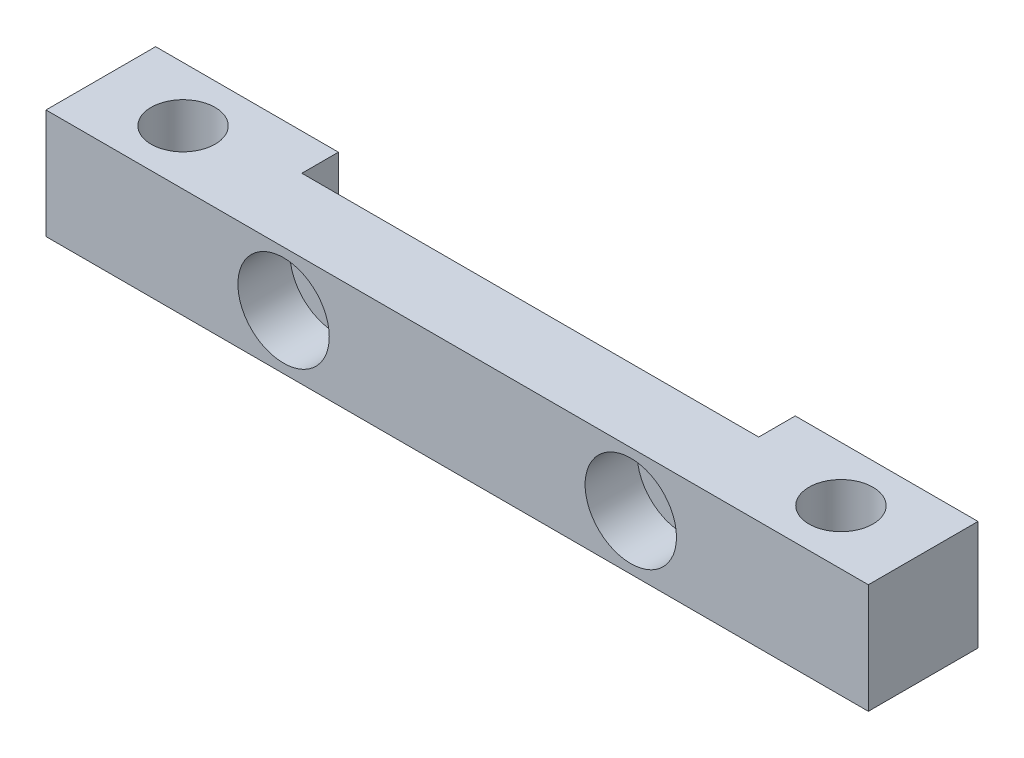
ISO-10303-21;
HEADER;
FILE_DESCRIPTION(('STEP AP214'),'2;1');
FILE_NAME('part.step','',(''),(''),'','','');
FILE_SCHEMA(('AUTOMOTIVE_DESIGN { 1 0 10303 214 1 1 1 1 }'));
ENDSEC;
DATA;
#1=APPLICATION_CONTEXT('core data for automotive mechanical design processes');
#2=APPLICATION_PROTOCOL_DEFINITION('international standard','automotive_design',2000,#1);
#3=PRODUCT_CONTEXT('',#1,'mechanical');
#4=PRODUCT('Part','Part','',(#3));
#5=PRODUCT_RELATED_PRODUCT_CATEGORY('part','',(#4));
#6=PRODUCT_DEFINITION_FORMATION('','',#4);
#7=PRODUCT_DEFINITION_CONTEXT('part definition',#1,'design');
#8=PRODUCT_DEFINITION('design','',#6,#7);
#9=PRODUCT_DEFINITION_SHAPE('','',#8);
#10=(LENGTH_UNIT() NAMED_UNIT(*) SI_UNIT(.MILLI.,.METRE.));
#11=(NAMED_UNIT(*) PLANE_ANGLE_UNIT() SI_UNIT($,.RADIAN.));
#12=(NAMED_UNIT(*) SI_UNIT($,.STERADIAN.) SOLID_ANGLE_UNIT());
#13=UNCERTAINTY_MEASURE_WITH_UNIT(LENGTH_MEASURE(1.E-05),#10,'distance_accuracy_value','');
#14=(GEOMETRIC_REPRESENTATION_CONTEXT(3) GLOBAL_UNCERTAINTY_ASSIGNED_CONTEXT((#13)) GLOBAL_UNIT_ASSIGNED_CONTEXT((#10,
#11,#12)) REPRESENTATION_CONTEXT('',''));
#15=CARTESIAN_POINT('',(0.,0.,0.));
#16=DIRECTION('',(0.,0.,1.));
#17=DIRECTION('',(1.,0.,0.));
#18=AXIS2_PLACEMENT_3D('',#15,#16,#17);
#19=CARTESIAN_POINT('',(0.,0.,0.));
#20=DIRECTION('',(0.,0.,1.));
#21=DIRECTION('',(1.,0.,0.));
#22=AXIS2_PLACEMENT_3D('',#19,#20,#21);
#23=PLANE('',#22);
#24=DIRECTION('',(-1.,0.,0.));
#25=VECTOR('',#24,1.);
#26=CARTESIAN_POINT('',(-349.652469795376,104.745464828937,0.));
#27=LINE('',#26,#25);
#28=CARTESIAN_POINT('',(-329.652469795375,104.745464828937,0.));
#29=VERTEX_POINT('',#28);
#30=CARTESIAN_POINT('',(-349.652469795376,104.745464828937,0.));
#31=VERTEX_POINT('',#30);
#32=EDGE_CURVE('E62',#29,#31,#27,.T.);
#33=ORIENTED_EDGE('',*,*,#32,.F.);
#34=DIRECTION('',(0.,1.,0.));
#35=VECTOR('',#34,1.);
#36=CARTESIAN_POINT('',(-329.652469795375,92.7454648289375,0.));
#37=LINE('',#36,#35);
#38=CARTESIAN_POINT('',(-329.652469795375,92.7454648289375,0.));
#39=VERTEX_POINT('',#38);
#40=EDGE_CURVE('E123',#39,#29,#37,.T.);
#41=ORIENTED_EDGE('',*,*,#40,.F.);
#42=DIRECTION('',(1.,0.,0.));
#43=VECTOR('',#42,1.);
#44=CARTESIAN_POINT('',(-349.652469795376,92.7454648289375,0.));
#45=LINE('',#44,#43);
#46=CARTESIAN_POINT('',(-349.652469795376,92.7454648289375,0.));
#47=VERTEX_POINT('',#46);
#48=EDGE_CURVE('E112',#47,#39,#45,.T.);
#49=ORIENTED_EDGE('',*,*,#48,.F.);
#50=DIRECTION('',(0.,-1.,0.));
#51=VECTOR('',#50,1.);
#52=CARTESIAN_POINT('',(-349.652469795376,104.745464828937,0.));
#53=LINE('',#52,#51);
#54=EDGE_CURVE('E149',#31,#47,#53,.T.);
#55=ORIENTED_EDGE('',*,*,#54,.F.);
#56=EDGE_LOOP('',(#33,#41,#49,#55));
#57=FACE_BOUND('',#56,.T.);
#58=ADVANCED_FACE('F16',(#57),#23,.F.);
#59=CARTESIAN_POINT('',(-349.652469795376,104.745464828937,12.));
#60=DIRECTION('',(1.,0.,0.));
#61=DIRECTION('',(0.,0.,-1.));
#62=AXIS2_PLACEMENT_3D('',#59,#60,#61);
#63=PLANE('',#62);
#64=ORIENTED_EDGE('',*,*,#54,.T.);
#65=DIRECTION('',(0.,0.,-1.));
#66=VECTOR('',#65,1.);
#67=CARTESIAN_POINT('',(-349.652469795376,92.7454648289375,12.));
#68=LINE('',#67,#66);
#69=CARTESIAN_POINT('',(-349.652469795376,92.7454648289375,12.));
#70=VERTEX_POINT('',#69);
#71=EDGE_CURVE('E11',#70,#47,#68,.T.);
#72=ORIENTED_EDGE('',*,*,#71,.F.);
#73=DIRECTION('',(0.,-1.,0.));
#74=VECTOR('',#73,1.);
#75=CARTESIAN_POINT('',(-349.652469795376,104.745464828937,12.));
#76=LINE('',#75,#74);
#77=CARTESIAN_POINT('',(-349.652469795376,104.745464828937,12.));
#78=VERTEX_POINT('',#77);
#79=EDGE_CURVE('E150',#78,#70,#76,.T.);
#80=ORIENTED_EDGE('',*,*,#79,.F.);
#81=DIRECTION('',(0.,0.,-1.));
#82=VECTOR('',#81,1.);
#83=CARTESIAN_POINT('',(-349.652469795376,104.745464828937,12.));
#84=LINE('',#83,#82);
#85=EDGE_CURVE('E157',#78,#31,#84,.T.);
#86=ORIENTED_EDGE('',*,*,#85,.T.);
#87=EDGE_LOOP('',(#64,#72,#80,#86));
#88=FACE_BOUND('',#87,.T.);
#89=ADVANCED_FACE('F18',(#88),#63,.F.);
#90=CARTESIAN_POINT('',(-349.652469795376,92.7454648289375,12.));
#91=DIRECTION('',(0.,1.,0.));
#92=DIRECTION('',(0.,0.,1.));
#93=AXIS2_PLACEMENT_3D('',#90,#91,#92);
#94=PLANE('',#93);
#95=CARTESIAN_POINT('',(-268.652469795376,92.7454648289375,6.));
#96=DIRECTION('',(0.,-1.,0.));
#97=DIRECTION('',(0.,0.,-1.));
#98=AXIS2_PLACEMENT_3D('',#95,#96,#97);
#99=CIRCLE('',#98,3.5);
#100=CARTESIAN_POINT('',(-268.652469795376,92.7454648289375,2.5));
#101=VERTEX_POINT('',#100);
#102=EDGE_CURVE('E218',#101,#101,#99,.T.);
#103=ORIENTED_EDGE('',*,*,#102,.F.);
#104=EDGE_LOOP('',(#103));
#105=FACE_BOUND('',#104,.T.);
#106=CARTESIAN_POINT('',(-340.652469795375,92.7454648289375,6.));
#107=DIRECTION('',(0.,-1.,0.));
#108=DIRECTION('',(0.,0.,-1.));
#109=AXIS2_PLACEMENT_3D('',#106,#107,#108);
#110=CIRCLE('',#109,3.5);
#111=CARTESIAN_POINT('',(-340.652469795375,92.7454648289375,2.5));
#112=VERTEX_POINT('',#111);
#113=EDGE_CURVE('E221',#112,#112,#110,.T.);
#114=ORIENTED_EDGE('',*,*,#113,.F.);
#115=EDGE_LOOP('',(#114));
#116=FACE_BOUND('',#115,.T.);
#117=ORIENTED_EDGE('',*,*,#48,.T.);
#118=DIRECTION('',(0.,0.,1.));
#119=VECTOR('',#118,1.);
#120=CARTESIAN_POINT('',(-329.652469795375,92.7454648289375,0.));
#121=LINE('',#120,#119);
#122=CARTESIAN_POINT('',(-329.652469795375,92.7454648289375,4.));
#123=VERTEX_POINT('',#122);
#124=EDGE_CURVE('E94',#39,#123,#121,.T.);
#125=ORIENTED_EDGE('',*,*,#124,.T.);
#126=DIRECTION('',(1.,0.,0.));
#127=VECTOR('',#126,1.);
#128=CARTESIAN_POINT('',(-329.652469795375,92.7454648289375,4.));
#129=LINE('',#128,#127);
#130=CARTESIAN_POINT('',(-279.652469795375,92.7454648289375,4.));
#131=VERTEX_POINT('',#130);
#132=EDGE_CURVE('E104',#123,#131,#129,.T.);
#133=ORIENTED_EDGE('',*,*,#132,.T.);
#134=DIRECTION('',(0.,0.,-1.));
#135=VECTOR('',#134,1.);
#136=CARTESIAN_POINT('',(-279.652469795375,92.7454648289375,0.));
#137=LINE('',#136,#135);
#138=CARTESIAN_POINT('',(-279.652469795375,92.7454648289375,0.));
#139=VERTEX_POINT('',#138);
#140=EDGE_CURVE('E101',#131,#139,#137,.T.);
#141=ORIENTED_EDGE('',*,*,#140,.T.);
#142=CARTESIAN_POINT('',(-259.652469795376,92.7454648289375,0.));
#143=VERTEX_POINT('',#142);
#144=EDGE_CURVE('E160',#139,#143,#45,.T.);
#145=ORIENTED_EDGE('',*,*,#144,.T.);
#146=DIRECTION('',(0.,0.,-1.));
#147=VECTOR('',#146,1.);
#148=CARTESIAN_POINT('',(-259.652469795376,92.7454648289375,12.));
#149=LINE('',#148,#147);
#150=CARTESIAN_POINT('',(-259.652469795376,92.7454648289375,12.));
#151=VERTEX_POINT('',#150);
#152=EDGE_CURVE('E25',#151,#143,#149,.T.);
#153=ORIENTED_EDGE('',*,*,#152,.F.);
#154=DIRECTION('',(1.,0.,0.));
#155=VECTOR('',#154,1.);
#156=CARTESIAN_POINT('',(-349.652469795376,92.7454648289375,12.));
#157=LINE('',#156,#155);
#158=EDGE_CURVE('E69',#70,#151,#157,.T.);
#159=ORIENTED_EDGE('',*,*,#158,.F.);
#160=ORIENTED_EDGE('',*,*,#71,.T.);
#161=EDGE_LOOP('',(#117,#125,#133,#141,#145,#153,#159,#160));
#162=FACE_BOUND('',#161,.T.);
#163=ADVANCED_FACE('F111',(#105,#116,#162),#94,.F.);
#164=CARTESIAN_POINT('',(-259.652469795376,104.745464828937,12.));
#165=DIRECTION('',(-1.,0.,0.));
#166=DIRECTION('',(0.,0.,1.));
#167=AXIS2_PLACEMENT_3D('',#164,#165,#166);
#168=PLANE('',#167);
#169=DIRECTION('',(0.,1.,0.));
#170=VECTOR('',#169,1.);
#171=CARTESIAN_POINT('',(-259.652469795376,104.745464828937,0.));
#172=LINE('',#171,#170);
#173=CARTESIAN_POINT('',(-259.652469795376,104.745464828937,0.));
#174=VERTEX_POINT('',#173);
#175=EDGE_CURVE('E162',#143,#174,#172,.T.);
#176=ORIENTED_EDGE('',*,*,#175,.T.);
#177=DIRECTION('',(0.,0.,-1.));
#178=VECTOR('',#177,1.);
#179=CARTESIAN_POINT('',(-259.652469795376,104.745464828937,12.));
#180=LINE('',#179,#178);
#181=CARTESIAN_POINT('',(-259.652469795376,104.745464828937,12.));
#182=VERTEX_POINT('',#181);
#183=EDGE_CURVE('E167',#182,#174,#180,.T.);
#184=ORIENTED_EDGE('',*,*,#183,.F.);
#185=DIRECTION('',(0.,1.,0.));
#186=VECTOR('',#185,1.);
#187=CARTESIAN_POINT('',(-259.652469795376,104.745464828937,12.));
#188=LINE('',#187,#186);
#189=EDGE_CURVE('E154',#151,#182,#188,.T.);
#190=ORIENTED_EDGE('',*,*,#189,.F.);
#191=ORIENTED_EDGE('',*,*,#152,.T.);
#192=EDGE_LOOP('',(#176,#184,#190,#191));
#193=FACE_BOUND('',#192,.T.);
#194=ADVANCED_FACE('F174',(#193),#168,.F.);
#195=CARTESIAN_POINT('',(-349.652469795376,104.745464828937,12.));
#196=DIRECTION('',(0.,-1.,0.));
#197=DIRECTION('',(0.,0.,-1.));
#198=AXIS2_PLACEMENT_3D('',#195,#196,#197);
#199=PLANE('',#198);
#200=CARTESIAN_POINT('',(-268.652469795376,104.745464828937,6.));
#201=DIRECTION('',(0.,-1.,0.));
#202=DIRECTION('',(0.,0.,-1.));
#203=AXIS2_PLACEMENT_3D('',#200,#201,#202);
#204=CIRCLE('',#203,3.5);
#205=CARTESIAN_POINT('',(-268.652469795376,104.745464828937,2.5));
#206=VERTEX_POINT('',#205);
#207=EDGE_CURVE('E223',#206,#206,#204,.T.);
#208=ORIENTED_EDGE('',*,*,#207,.T.);
#209=EDGE_LOOP('',(#208));
#210=FACE_BOUND('',#209,.T.);
#211=CARTESIAN_POINT('',(-340.652469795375,104.745464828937,6.));
#212=DIRECTION('',(0.,-1.,0.));
#213=DIRECTION('',(0.,0.,-1.));
#214=AXIS2_PLACEMENT_3D('',#211,#212,#213);
#215=CIRCLE('',#214,3.5);
#216=CARTESIAN_POINT('',(-340.652469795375,104.745464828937,2.5));
#217=VERTEX_POINT('',#216);
#218=EDGE_CURVE('E117',#217,#217,#215,.T.);
#219=ORIENTED_EDGE('',*,*,#218,.T.);
#220=EDGE_LOOP('',(#219));
#221=FACE_BOUND('',#220,.T.);
#222=DIRECTION('',(1.,0.,0.));
#223=VECTOR('',#222,1.);
#224=CARTESIAN_POINT('',(-329.652469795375,104.745464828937,4.));
#225=LINE('',#224,#223);
#226=CARTESIAN_POINT('',(-329.652469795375,104.745464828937,4.));
#227=VERTEX_POINT('',#226);
#228=CARTESIAN_POINT('',(-279.652469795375,104.745464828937,4.));
#229=VERTEX_POINT('',#228);
#230=EDGE_CURVE('E114',#227,#229,#225,.T.);
#231=ORIENTED_EDGE('',*,*,#230,.F.);
#232=DIRECTION('',(0.,0.,1.));
#233=VECTOR('',#232,1.);
#234=CARTESIAN_POINT('',(-329.652469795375,104.745464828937,0.));
#235=LINE('',#234,#233);
#236=EDGE_CURVE('E96',#29,#227,#235,.T.);
#237=ORIENTED_EDGE('',*,*,#236,.F.);
#238=ORIENTED_EDGE('',*,*,#32,.T.);
#239=ORIENTED_EDGE('',*,*,#85,.F.);
#240=DIRECTION('',(-1.,0.,0.));
#241=VECTOR('',#240,1.);
#242=CARTESIAN_POINT('',(-349.652469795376,104.745464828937,12.));
#243=LINE('',#242,#241);
#244=EDGE_CURVE('E41',#182,#78,#243,.T.);
#245=ORIENTED_EDGE('',*,*,#244,.F.);
#246=ORIENTED_EDGE('',*,*,#183,.T.);
#247=CARTESIAN_POINT('',(-279.652469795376,104.745464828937,0.));
#248=VERTEX_POINT('',#247);
#249=EDGE_CURVE('E152',#174,#248,#27,.T.);
#250=ORIENTED_EDGE('',*,*,#249,.T.);
#251=DIRECTION('',(0.,0.,-1.));
#252=VECTOR('',#251,1.);
#253=CARTESIAN_POINT('',(-279.652469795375,104.745464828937,0.));
#254=LINE('',#253,#252);
#255=EDGE_CURVE('E32',#229,#248,#254,.T.);
#256=ORIENTED_EDGE('',*,*,#255,.F.);
#257=EDGE_LOOP('',(#231,#237,#238,#239,#245,#246,#250,#256));
#258=FACE_BOUND('',#257,.T.);
#259=ADVANCED_FACE('F180',(#210,#221,#258),#199,.F.);
#260=CARTESIAN_POINT('',(0.,0.,12.));
#261=DIRECTION('',(0.,0.,1.));
#262=DIRECTION('',(1.,0.,0.));
#263=AXIS2_PLACEMENT_3D('',#260,#261,#262);
#264=PLANE('',#263);
#265=CARTESIAN_POINT('',(-285.652469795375,98.7454648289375,12.));
#266=DIRECTION('',(0.,0.,1.));
#267=DIRECTION('',(1.,0.,0.));
#268=AXIS2_PLACEMENT_3D('',#265,#266,#267);
#269=CIRCLE('',#268,5.);
#270=CARTESIAN_POINT('',(-280.652469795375,98.7454648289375,12.));
#271=VERTEX_POINT('',#270);
#272=EDGE_CURVE('E131',#271,#271,#269,.T.);
#273=ORIENTED_EDGE('',*,*,#272,.F.);
#274=EDGE_LOOP('',(#273));
#275=FACE_BOUND('',#274,.T.);
#276=CARTESIAN_POINT('',(-323.652469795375,98.7454648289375,12.));
#277=DIRECTION('',(0.,0.,1.));
#278=DIRECTION('',(1.,0.,0.));
#279=AXIS2_PLACEMENT_3D('',#276,#277,#278);
#280=CIRCLE('',#279,5.);
#281=CARTESIAN_POINT('',(-318.652469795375,98.7454648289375,12.));
#282=VERTEX_POINT('',#281);
#283=EDGE_CURVE('E140',#282,#282,#280,.T.);
#284=ORIENTED_EDGE('',*,*,#283,.F.);
#285=EDGE_LOOP('',(#284));
#286=FACE_BOUND('',#285,.T.);
#287=ORIENTED_EDGE('',*,*,#79,.T.);
#288=ORIENTED_EDGE('',*,*,#158,.T.);
#289=ORIENTED_EDGE('',*,*,#189,.T.);
#290=ORIENTED_EDGE('',*,*,#244,.T.);
#291=EDGE_LOOP('',(#287,#288,#289,#290));
#292=FACE_BOUND('',#291,.T.);
#293=ADVANCED_FACE('F185',(#275,#286,#292),#264,.T.);
#294=ORIENTED_EDGE('',*,*,#144,.F.);
#295=DIRECTION('',(0.,1.,0.));
#296=VECTOR('',#295,1.);
#297=CARTESIAN_POINT('',(-279.652469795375,92.7454648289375,0.));
#298=LINE('',#297,#296);
#299=EDGE_CURVE('E125',#139,#248,#298,.T.);
#300=ORIENTED_EDGE('',*,*,#299,.T.);
#301=ORIENTED_EDGE('',*,*,#249,.F.);
#302=ORIENTED_EDGE('',*,*,#175,.F.);
#303=EDGE_LOOP('',(#294,#300,#301,#302));
#304=FACE_BOUND('',#303,.T.);
#305=ADVANCED_FACE('F179',(#304),#23,.F.);
#306=CARTESIAN_POINT('',(-323.652469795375,98.7454648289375,12.));
#307=DIRECTION('',(0.,0.,1.));
#308=DIRECTION('',(1.,0.,0.));
#309=AXIS2_PLACEMENT_3D('',#306,#307,#308);
#310=CYLINDRICAL_SURFACE('',#309,2.75);
#311=CARTESIAN_POINT('',(-323.652469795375,98.7454648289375,4.));
#312=DIRECTION('',(0.,0.,1.));
#313=DIRECTION('',(1.,0.,0.));
#314=AXIS2_PLACEMENT_3D('',#311,#312,#313);
#315=CIRCLE('',#314,2.75);
#316=CARTESIAN_POINT('',(-320.902469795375,98.7454648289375,4.));
#317=VERTEX_POINT('',#316);
#318=EDGE_CURVE('E128',#317,#317,#315,.F.);
#319=ORIENTED_EDGE('',*,*,#318,.T.);
#320=EDGE_LOOP('',(#319));
#321=FACE_BOUND('',#320,.T.);
#322=CARTESIAN_POINT('',(-323.652469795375,98.7454648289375,6.3));
#323=DIRECTION('',(0.,0.,1.));
#324=DIRECTION('',(1.,0.,0.));
#325=AXIS2_PLACEMENT_3D('',#322,#323,#324);
#326=CIRCLE('',#325,2.75);
#327=CARTESIAN_POINT('',(-320.902469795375,98.7454648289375,6.3));
#328=VERTEX_POINT('',#327);
#329=EDGE_CURVE('E146',#328,#328,#326,.T.);
#330=ORIENTED_EDGE('',*,*,#329,.T.);
#331=EDGE_LOOP('',(#330));
#332=FACE_BOUND('',#331,.T.);
#333=ADVANCED_FACE('F195',(#321,#332),#310,.F.);
#334=CARTESIAN_POINT('',(-320.902469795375,98.7454648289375,6.3));
#335=DIRECTION('',(0.,0.,-1.));
#336=DIRECTION('',(-1.,0.,0.));
#337=AXIS2_PLACEMENT_3D('',#334,#335,#336);
#338=PLANE('',#337);
#339=ORIENTED_EDGE('',*,*,#329,.F.);
#340=EDGE_LOOP('',(#339));
#341=FACE_BOUND('',#340,.T.);
#342=CARTESIAN_POINT('',(-323.652469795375,98.7454648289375,6.3));
#343=DIRECTION('',(0.,0.,1.));
#344=DIRECTION('',(1.,0.,0.));
#345=AXIS2_PLACEMENT_3D('',#342,#343,#344);
#346=CIRCLE('',#345,5.);
#347=CARTESIAN_POINT('',(-318.652469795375,98.7454648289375,6.3));
#348=VERTEX_POINT('',#347);
#349=EDGE_CURVE('E143',#348,#348,#346,.T.);
#350=ORIENTED_EDGE('',*,*,#349,.T.);
#351=EDGE_LOOP('',(#350));
#352=FACE_BOUND('',#351,.T.);
#353=ADVANCED_FACE('F265',(#341,#352),#338,.F.);
#354=CARTESIAN_POINT('',(-323.652469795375,98.7454648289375,12.));
#355=DIRECTION('',(0.,0.,1.));
#356=DIRECTION('',(1.,0.,0.));
#357=AXIS2_PLACEMENT_3D('',#354,#355,#356);
#358=CYLINDRICAL_SURFACE('',#357,5.);
#359=ORIENTED_EDGE('',*,*,#349,.F.);
#360=EDGE_LOOP('',(#359));
#361=FACE_BOUND('',#360,.T.);
#362=ORIENTED_EDGE('',*,*,#283,.T.);
#363=EDGE_LOOP('',(#362));
#364=FACE_BOUND('',#363,.T.);
#365=ADVANCED_FACE('F261',(#361,#364),#358,.F.);
#366=CARTESIAN_POINT('',(-285.652469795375,98.7454648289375,12.));
#367=DIRECTION('',(0.,0.,1.));
#368=DIRECTION('',(1.,0.,0.));
#369=AXIS2_PLACEMENT_3D('',#366,#367,#368);
#370=CYLINDRICAL_SURFACE('',#369,2.75);
#371=CARTESIAN_POINT('',(-285.652469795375,98.7454648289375,4.));
#372=DIRECTION('',(0.,0.,1.));
#373=DIRECTION('',(1.,0.,0.));
#374=AXIS2_PLACEMENT_3D('',#371,#372,#373);
#375=CIRCLE('',#374,2.75);
#376=CARTESIAN_POINT('',(-282.902469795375,98.7454648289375,4.));
#377=VERTEX_POINT('',#376);
#378=EDGE_CURVE('E20',#377,#377,#375,.F.);
#379=ORIENTED_EDGE('',*,*,#378,.T.);
#380=EDGE_LOOP('',(#379));
#381=FACE_BOUND('',#380,.T.);
#382=CARTESIAN_POINT('',(-285.652469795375,98.7454648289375,6.3));
#383=DIRECTION('',(0.,0.,1.));
#384=DIRECTION('',(1.,0.,0.));
#385=AXIS2_PLACEMENT_3D('',#382,#383,#384);
#386=CIRCLE('',#385,2.75);
#387=CARTESIAN_POINT('',(-282.902469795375,98.7454648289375,6.3));
#388=VERTEX_POINT('',#387);
#389=EDGE_CURVE('E137',#388,#388,#386,.T.);
#390=ORIENTED_EDGE('',*,*,#389,.T.);
#391=EDGE_LOOP('',(#390));
#392=FACE_BOUND('',#391,.T.);
#393=ADVANCED_FACE('F257',(#381,#392),#370,.F.);
#394=CARTESIAN_POINT('',(-282.902469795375,98.7454648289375,6.3));
#395=DIRECTION('',(0.,0.,-1.));
#396=DIRECTION('',(-1.,0.,0.));
#397=AXIS2_PLACEMENT_3D('',#394,#395,#396);
#398=PLANE('',#397);
#399=ORIENTED_EDGE('',*,*,#389,.F.);
#400=EDGE_LOOP('',(#399));
#401=FACE_BOUND('',#400,.T.);
#402=CARTESIAN_POINT('',(-285.652469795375,98.7454648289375,6.3));
#403=DIRECTION('',(0.,0.,1.));
#404=DIRECTION('',(1.,0.,0.));
#405=AXIS2_PLACEMENT_3D('',#402,#403,#404);
#406=CIRCLE('',#405,5.);
#407=CARTESIAN_POINT('',(-280.652469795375,98.7454648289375,6.3));
#408=VERTEX_POINT('',#407);
#409=EDGE_CURVE('E134',#408,#408,#406,.T.);
#410=ORIENTED_EDGE('',*,*,#409,.T.);
#411=EDGE_LOOP('',(#410));
#412=FACE_BOUND('',#411,.T.);
#413=ADVANCED_FACE('F253',(#401,#412),#398,.F.);
#414=CARTESIAN_POINT('',(-285.652469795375,98.7454648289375,12.));
#415=DIRECTION('',(0.,0.,1.));
#416=DIRECTION('',(1.,0.,0.));
#417=AXIS2_PLACEMENT_3D('',#414,#415,#416);
#418=CYLINDRICAL_SURFACE('',#417,5.);
#419=ORIENTED_EDGE('',*,*,#409,.F.);
#420=EDGE_LOOP('',(#419));
#421=FACE_BOUND('',#420,.T.);
#422=ORIENTED_EDGE('',*,*,#272,.T.);
#423=EDGE_LOOP('',(#422));
#424=FACE_BOUND('',#423,.T.);
#425=ADVANCED_FACE('F247',(#421,#424),#418,.F.);
#426=CARTESIAN_POINT('',(-329.652469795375,92.7454648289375,4.));
#427=DIRECTION('',(0.,0.,1.));
#428=DIRECTION('',(1.,0.,0.));
#429=AXIS2_PLACEMENT_3D('',#426,#427,#428);
#430=PLANE('',#429);
#431=ORIENTED_EDGE('',*,*,#378,.F.);
#432=EDGE_LOOP('',(#431));
#433=FACE_BOUND('',#432,.T.);
#434=ORIENTED_EDGE('',*,*,#230,.T.);
#435=DIRECTION('',(0.,1.,0.));
#436=VECTOR('',#435,1.);
#437=CARTESIAN_POINT('',(-279.652469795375,92.7454648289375,4.));
#438=LINE('',#437,#436);
#439=EDGE_CURVE('E100',#131,#229,#438,.T.);
#440=ORIENTED_EDGE('',*,*,#439,.F.);
#441=ORIENTED_EDGE('',*,*,#132,.F.);
#442=DIRECTION('',(0.,1.,0.));
#443=VECTOR('',#442,1.);
#444=CARTESIAN_POINT('',(-329.652469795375,92.7454648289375,4.));
#445=LINE('',#444,#443);
#446=EDGE_CURVE('E90',#123,#227,#445,.T.);
#447=ORIENTED_EDGE('',*,*,#446,.T.);
#448=EDGE_LOOP('',(#434,#440,#441,#447));
#449=FACE_BOUND('',#448,.T.);
#450=ORIENTED_EDGE('',*,*,#318,.F.);
#451=EDGE_LOOP('',(#450));
#452=FACE_BOUND('',#451,.T.);
#453=ADVANCED_FACE('F105',(#433,#449,#452),#430,.F.);
#454=CARTESIAN_POINT('',(-329.652469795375,92.7454648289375,0.));
#455=DIRECTION('',(-1.,0.,0.));
#456=DIRECTION('',(0.,0.,1.));
#457=AXIS2_PLACEMENT_3D('',#454,#455,#456);
#458=PLANE('',#457);
#459=ORIENTED_EDGE('',*,*,#236,.T.);
#460=ORIENTED_EDGE('',*,*,#446,.F.);
#461=ORIENTED_EDGE('',*,*,#124,.F.);
#462=ORIENTED_EDGE('',*,*,#40,.T.);
#463=EDGE_LOOP('',(#459,#460,#461,#462));
#464=FACE_BOUND('',#463,.T.);
#465=ADVANCED_FACE('F92',(#464),#458,.F.);
#466=CARTESIAN_POINT('',(-279.652469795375,92.7454648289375,0.));
#467=DIRECTION('',(1.,0.,0.));
#468=DIRECTION('',(0.,0.,-1.));
#469=AXIS2_PLACEMENT_3D('',#466,#467,#468);
#470=PLANE('',#469);
#471=ORIENTED_EDGE('',*,*,#255,.T.);
#472=ORIENTED_EDGE('',*,*,#299,.F.);
#473=ORIENTED_EDGE('',*,*,#140,.F.);
#474=ORIENTED_EDGE('',*,*,#439,.T.);
#475=EDGE_LOOP('',(#471,#472,#473,#474));
#476=FACE_BOUND('',#475,.T.);
#477=ADVANCED_FACE('F238',(#476),#470,.F.);
#478=CARTESIAN_POINT('',(-340.652469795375,92.7454648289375,6.));
#479=DIRECTION('',(0.,-1.,0.));
#480=DIRECTION('',(0.,0.,-1.));
#481=AXIS2_PLACEMENT_3D('',#478,#479,#480);
#482=CYLINDRICAL_SURFACE('',#481,3.5);
#483=ORIENTED_EDGE('',*,*,#218,.F.);
#484=EDGE_LOOP('',(#483));
#485=FACE_BOUND('',#484,.T.);
#486=ORIENTED_EDGE('',*,*,#113,.T.);
#487=EDGE_LOOP('',(#486));
#488=FACE_BOUND('',#487,.T.);
#489=ADVANCED_FACE('F231',(#485,#488),#482,.F.);
#490=CARTESIAN_POINT('',(-268.652469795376,92.7454648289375,6.));
#491=DIRECTION('',(0.,-1.,0.));
#492=DIRECTION('',(0.,0.,-1.));
#493=AXIS2_PLACEMENT_3D('',#490,#491,#492);
#494=CYLINDRICAL_SURFACE('',#493,3.5);
#495=ORIENTED_EDGE('',*,*,#207,.F.);
#496=EDGE_LOOP('',(#495));
#497=FACE_BOUND('',#496,.T.);
#498=ORIENTED_EDGE('',*,*,#102,.T.);
#499=EDGE_LOOP('',(#498));
#500=FACE_BOUND('',#499,.T.);
#501=ADVANCED_FACE('F229',(#497,#500),#494,.F.);
#502=CLOSED_SHELL('',(#58,#89,#163,#194,#259,#293,#305,#333,#353,#365,#393,#413,#425,#453,#465,
#477,#489,#501));
#503=MANIFOLD_SOLID_BREP('B1',#502);
#504=ADVANCED_BREP_SHAPE_REPRESENTATION('',(#18,#503),#14);
#505=SHAPE_DEFINITION_REPRESENTATION(#9,#504);
ENDSEC;
END-ISO-10303-21;
